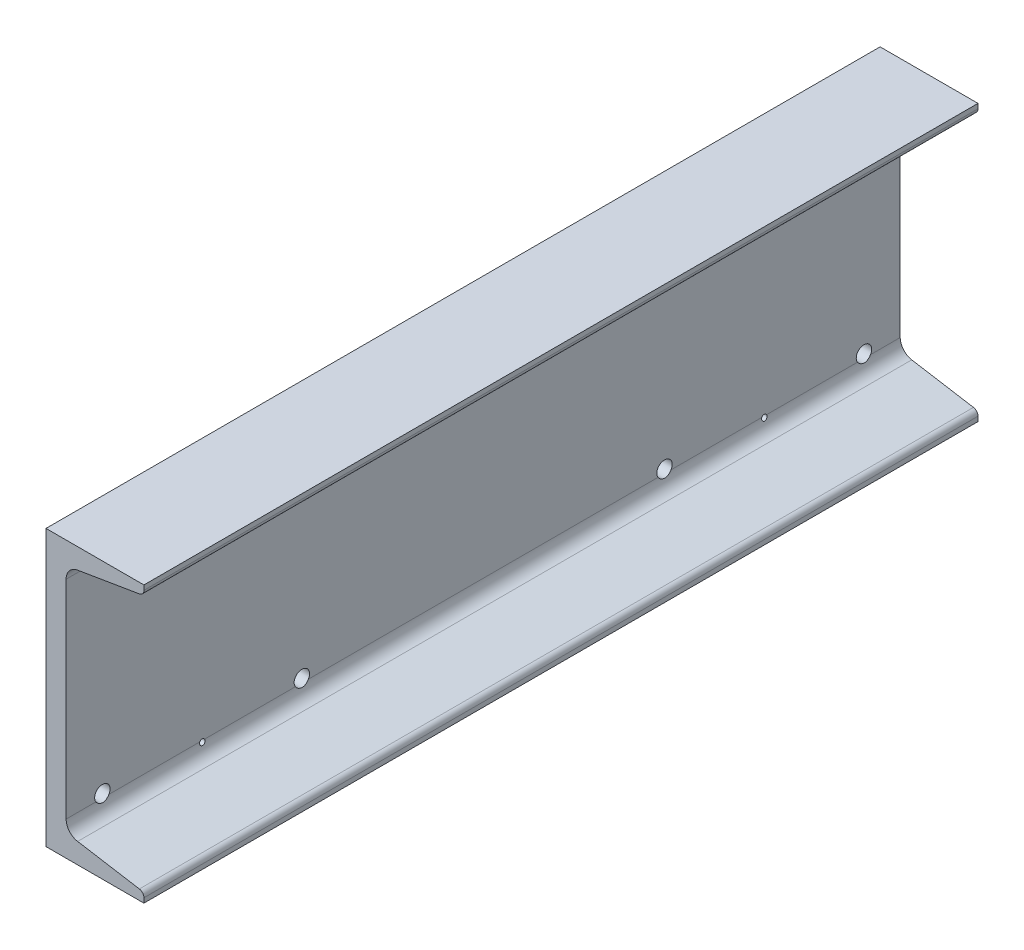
from build123d import *

# Parameters (mm, degrees)
BASEMCHANNEL_DEPTH              = 230
TOEFILLET_R                     = 3
M10X1_5_GEWINDEKERNLOCH1_D      = 8.5
LINEARES_MUSTER1_COUNT          = 2
LINEARES_MUSTER1_PITCH          = 310
SKIZZE3_R                       = 1.5
SCHNITT_LINEAR_AUSTRAGEN1_DEPTH = 281.927036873


with BuildPart() as part:
    # Sketch1 → BaseMchannel (new, symmetric)
    with BuildSketch(Plane.XY):
        with BuildLine():
            Line((54, 152), (0, 152))
            Line((0, 152), (0, 0))
            Line((0, 0), (54, 0))
            Line((54, 0), (54, 5.124739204))
            Line((54, 5.124739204), (17.450479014, 11.216770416))
            ThreePointArc((17.450479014, 11.216770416), (12.901019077, 13.800934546), (11.1, 18.713349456))
            Line((11.1, 18.713349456), (11.1, 133.286650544))
            ThreePointArc((11.1, 133.286650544), (12.901019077, 138.199065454), (17.450479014, 140.783229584))
            Line((17.450479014, 140.783229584), (54, 146.875260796))
            Line((54, 146.875260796), (54, 152))
        make_face()
    extrude(amount=BASEMCHANNEL_DEPTH, both=True)

    # ToeFillet
    toefillet_edges = [part.edges().sort_by_distance(p)[0] for p in [
        (54, 146.875260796, 0),
        (54, 5.124739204, 0),
    ]]
    fillet(toefillet_edges, radius=TOEFILLET_R)

    # M10x1.5 Gewindekernloch1 (through all)
    with Locations(Plane.ZY):
        with Locations((-210, 21), (-210, 131), (-100, 131), (-100, 21)):
            m10x1_5_gewindekernloch1 = Hole(M10X1_5_GEWINDEKERNLOCH1_D / 2)

    # Lineares Muster1: M10x1.5 Gewindekernloch1 ×2
    with Locations(*[(0, 0, i * LINEARES_MUSTER1_PITCH) for i in range(1, LINEARES_MUSTER1_COUNT)]):
        add(m10x1_5_gewindekernloch1, mode=Mode.SUBTRACT)

    # Skizze3 → Schnitt-Linear austragen1 (cut, through all)
    with BuildSketch(Plane.ZY):
        with Locations(Location((155, 18, 0), (0, 0, 270))):
            Circle(SKIZZE3_R)
        with Locations(Location((155, 134, 0), (0, 0, 270))):
            Circle(SKIZZE3_R)
    schnitt_linear_austragen1 = extrude(amount=-SCHNITT_LINEAR_AUSTRAGEN1_DEPTH, mode=Mode.SUBTRACT)

    # Spiegeln1: Schnitt-Linear austragen1 across plane
    add(schnitt_linear_austragen1.mirror(Plane.XY), mode=Mode.SUBTRACT)


solid = part.part
